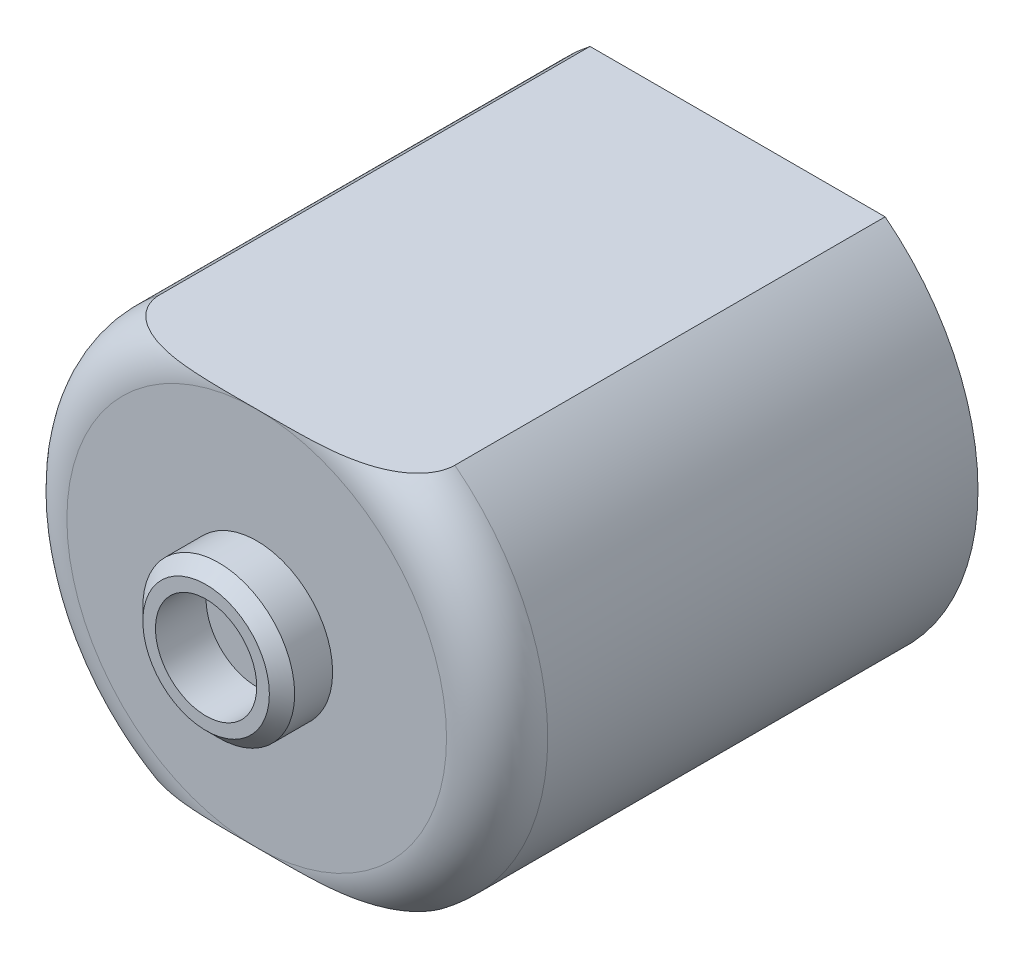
ISO-10303-21;
HEADER;
FILE_DESCRIPTION(('STEP AP214'),'2;1');
FILE_NAME('part.step','',(''),(''),'','','');
FILE_SCHEMA(('AUTOMOTIVE_DESIGN { 1 0 10303 214 1 1 1 1 }'));
ENDSEC;
DATA;
#1=APPLICATION_CONTEXT('core data for automotive mechanical design processes');
#2=APPLICATION_PROTOCOL_DEFINITION('international standard','automotive_design',2000,#1);
#3=PRODUCT_CONTEXT('',#1,'mechanical');
#4=PRODUCT('Part','Part','',(#3));
#5=PRODUCT_RELATED_PRODUCT_CATEGORY('part','',(#4));
#6=PRODUCT_DEFINITION_FORMATION('','',#4);
#7=PRODUCT_DEFINITION_CONTEXT('part definition',#1,'design');
#8=PRODUCT_DEFINITION('design','',#6,#7);
#9=PRODUCT_DEFINITION_SHAPE('','',#8);
#10=(LENGTH_UNIT() NAMED_UNIT(*) SI_UNIT(.MILLI.,.METRE.));
#11=(NAMED_UNIT(*) PLANE_ANGLE_UNIT() SI_UNIT($,.RADIAN.));
#12=(NAMED_UNIT(*) SI_UNIT($,.STERADIAN.) SOLID_ANGLE_UNIT());
#13=UNCERTAINTY_MEASURE_WITH_UNIT(LENGTH_MEASURE(1.E-05),#10,'distance_accuracy_value','');
#14=(GEOMETRIC_REPRESENTATION_CONTEXT(3) GLOBAL_UNCERTAINTY_ASSIGNED_CONTEXT((#13)) GLOBAL_UNIT_ASSIGNED_CONTEXT((#10,
#11,#12)) REPRESENTATION_CONTEXT('',''));
#15=CARTESIAN_POINT('',(0.,0.,0.));
#16=DIRECTION('',(0.,0.,1.));
#17=DIRECTION('',(1.,0.,0.));
#18=AXIS2_PLACEMENT_3D('',#15,#16,#17);
#19=CARTESIAN_POINT('',(0.,0.,19.));
#20=DIRECTION('',(0.,0.,1.));
#21=DIRECTION('',(1.,0.,0.));
#22=AXIS2_PLACEMENT_3D('',#19,#20,#21);
#23=PLANE('',#22);
#24=CARTESIAN_POINT('',(0.,0.,19.));
#25=DIRECTION('',(0.,0.,1.));
#26=DIRECTION('',(1.,0.,0.));
#27=AXIS2_PLACEMENT_3D('',#24,#25,#26);
#28=CIRCLE('',#27,7.5);
#29=CARTESIAN_POINT('',(0.,7.5,19.));
#30=VERTEX_POINT('',#29);
#31=CARTESIAN_POINT('',(0.,-7.5,19.));
#32=VERTEX_POINT('',#31);
#33=EDGE_CURVE('E441',#30,#32,#28,.T.);
#34=ORIENTED_EDGE('',*,*,#33,.T.);
#35=EDGE_CURVE('E440',#32,#30,#28,.T.);
#36=ORIENTED_EDGE('',*,*,#35,.T.);
#37=EDGE_LOOP('',(#34,#36));
#38=FACE_BOUND('',#37,.T.);
#39=CARTESIAN_POINT('',(0.,0.,19.));
#40=DIRECTION('',(0.,0.,1.));
#41=DIRECTION('',(1.,0.,0.));
#42=AXIS2_PLACEMENT_3D('',#39,#40,#41);
#43=CIRCLE('',#42,3.);
#44=CARTESIAN_POINT('',(3.,0.,19.));
#45=VERTEX_POINT('',#44);
#46=EDGE_CURVE('E429',#45,#45,#43,.T.);
#47=ORIENTED_EDGE('',*,*,#46,.F.);
#48=EDGE_LOOP('',(#47));
#49=FACE_BOUND('',#48,.T.);
#50=ADVANCED_FACE('F358',(#38,#49),#23,.T.);
#51=CARTESIAN_POINT('',(0.,0.,19.));
#52=DIRECTION('',(0.,0.,-1.));
#53=DIRECTION('',(-1.,0.,0.));
#54=AXIS2_PLACEMENT_3D('',#51,#52,#53);
#55=CYLINDRICAL_SURFACE('',#54,9.5);
#56=CARTESIAN_POINT('',(0.,0.,17.));
#57=DIRECTION('',(0.,0.,1.));
#58=DIRECTION('',(1.,0.,0.));
#59=AXIS2_PLACEMENT_3D('',#56,#57,#58);
#60=CIRCLE('',#59,9.5);
#61=CARTESIAN_POINT('',(-5.83095189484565,-7.5,17.0000000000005));
#62=VERTEX_POINT('',#61);
#63=CARTESIAN_POINT('',(-5.8309518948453,7.5,17.));
#64=VERTEX_POINT('',#63);
#65=EDGE_CURVE('E444',#62,#64,#60,.F.);
#66=ORIENTED_EDGE('',*,*,#65,.T.);
#67=DIRECTION('',(0.,0.,-1.));
#68=VECTOR('',#67,1.);
#69=CARTESIAN_POINT('',(-5.8309518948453,7.5,19.));
#70=LINE('',#69,#68);
#71=CARTESIAN_POINT('',(-5.8309518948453,7.5,0.));
#72=VERTEX_POINT('',#71);
#73=EDGE_CURVE('E412',#72,#64,#70,.F.);
#74=ORIENTED_EDGE('',*,*,#73,.F.);
#75=CARTESIAN_POINT('',(0.,0.,0.));
#76=DIRECTION('',(0.,0.,1.));
#77=DIRECTION('',(1.,0.,0.));
#78=AXIS2_PLACEMENT_3D('',#75,#76,#77);
#79=CIRCLE('',#78,9.5);
#80=CARTESIAN_POINT('',(-5.8309518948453,-7.5,0.));
#81=VERTEX_POINT('',#80);
#82=EDGE_CURVE('E408',#72,#81,#79,.T.);
#83=ORIENTED_EDGE('',*,*,#82,.T.);
#84=DIRECTION('',(0.,0.,-1.));
#85=VECTOR('',#84,1.);
#86=CARTESIAN_POINT('',(-5.8309518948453,-7.5,19.));
#87=LINE('',#86,#85);
#88=EDGE_CURVE('E410',#62,#81,#87,.T.);
#89=ORIENTED_EDGE('',*,*,#88,.F.);
#90=EDGE_LOOP('',(#66,#74,#83,#89));
#91=FACE_BOUND('',#90,.T.);
#92=ADVANCED_FACE('F360',(#91),#55,.T.);
#93=DIRECTION('',(0.,0.,-1.));
#94=VECTOR('',#93,1.);
#95=CARTESIAN_POINT('',(5.8309518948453,-7.5,19.));
#96=LINE('',#95,#94);
#97=CARTESIAN_POINT('',(5.8309518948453,-7.5,0.));
#98=VERTEX_POINT('',#97);
#99=CARTESIAN_POINT('',(5.8309518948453,-7.5,17.));
#100=VERTEX_POINT('',#99);
#101=EDGE_CURVE('E424',#98,#100,#96,.F.);
#102=ORIENTED_EDGE('',*,*,#101,.F.);
#103=CARTESIAN_POINT('',(5.8309518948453,7.5,0.));
#104=VERTEX_POINT('',#103);
#105=EDGE_CURVE('E416',#98,#104,#79,.T.);
#106=ORIENTED_EDGE('',*,*,#105,.T.);
#107=DIRECTION('',(0.,0.,-1.));
#108=VECTOR('',#107,1.);
#109=CARTESIAN_POINT('',(5.8309518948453,7.5,19.));
#110=LINE('',#109,#108);
#111=CARTESIAN_POINT('',(5.83095189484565,7.5,17.0000000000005));
#112=VERTEX_POINT('',#111);
#113=EDGE_CURVE('E417',#112,#104,#110,.T.);
#114=ORIENTED_EDGE('',*,*,#113,.F.);
#115=EDGE_CURVE('E445',#112,#100,#60,.F.);
#116=ORIENTED_EDGE('',*,*,#115,.T.);
#117=EDGE_LOOP('',(#102,#106,#114,#116));
#118=FACE_BOUND('',#117,.T.);
#119=ADVANCED_FACE('F495',(#118),#55,.T.);
#120=CARTESIAN_POINT('',(0.,0.,0.));
#121=DIRECTION('',(0.,0.,1.));
#122=DIRECTION('',(1.,0.,0.));
#123=AXIS2_PLACEMENT_3D('',#120,#121,#122);
#124=PLANE('',#123);
#125=DIRECTION('',(-1.,0.,0.));
#126=VECTOR('',#125,1.);
#127=CARTESIAN_POINT('',(-9.5,7.5,0.));
#128=LINE('',#127,#126);
#129=EDGE_CURVE('E428',#104,#72,#128,.T.);
#130=ORIENTED_EDGE('',*,*,#129,.F.);
#131=ORIENTED_EDGE('',*,*,#105,.F.);
#132=DIRECTION('',(1.,0.,0.));
#133=VECTOR('',#132,1.);
#134=CARTESIAN_POINT('',(-9.5,-7.5,0.));
#135=LINE('',#134,#133);
#136=EDGE_CURVE('E421',#81,#98,#135,.T.);
#137=ORIENTED_EDGE('',*,*,#136,.F.);
#138=ORIENTED_EDGE('',*,*,#82,.F.);
#139=EDGE_LOOP('',(#130,#131,#137,#138));
#140=FACE_BOUND('',#139,.T.);
#141=ADVANCED_FACE('F426',(#140),#124,.F.);
#142=CARTESIAN_POINT('',(0.,0.,17.));
#143=DIRECTION('',(0.,0.,1.));
#144=DIRECTION('',(1.,0.,0.));
#145=AXIS2_PLACEMENT_3D('',#142,#143,#144);
#146=TOROIDAL_SURFACE('',#145,7.5,2.);
#147=ORIENTED_EDGE('',*,*,#33,.F.);
#148=CARTESIAN_POINT('',(0.,7.5,19.0000000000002));
#149=CARTESIAN_POINT('',(-0.168645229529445,7.5,19.0000001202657));
#150=CARTESIAN_POINT('',(-0.337290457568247,7.5,19.0000243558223));
#151=CARTESIAN_POINT('',(-0.674588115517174,7.5,18.9998303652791));
#152=CARTESIAN_POINT('',(-0.843240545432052,7.5,18.9996121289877));
#153=CARTESIAN_POINT('',(-1.18100400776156,7.5,18.9980762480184));
#154=CARTESIAN_POINT('',(-1.35011503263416,7.5,18.9967555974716));
#155=CARTESIAN_POINT('',(-1.68829538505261,7.5,18.9916270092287));
#156=CARTESIAN_POINT('',(-1.85736471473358,7.5,18.9878192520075));
#157=CARTESIAN_POINT('',(-2.19272713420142,7.5,18.9759495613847));
#158=CARTESIAN_POINT('',(-2.35902235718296,7.5,18.9679549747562));
#159=CARTESIAN_POINT('',(-2.69127574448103,7.5,18.9455429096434));
#160=CARTESIAN_POINT('',(-2.85723376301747,7.5,18.9311230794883));
#161=CARTESIAN_POINT('',(-3.18746730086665,7.5,18.8932809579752));
#162=CARTESIAN_POINT('',(-3.35174693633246,7.5,18.8698960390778));
#163=CARTESIAN_POINT('',(-3.67807384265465,7.5,18.8109958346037));
#164=CARTESIAN_POINT('',(-3.84012336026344,7.5,18.7754938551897));
#165=CARTESIAN_POINT('',(-4.06748234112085,7.5,18.7137139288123));
#166=CARTESIAN_POINT('',(-4.13457756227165,7.5,18.6939622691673));
#167=CARTESIAN_POINT('',(-4.2677861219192,7.5,18.6512868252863));
#168=CARTESIAN_POINT('',(-4.33389910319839,7.5,18.6283619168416));
#169=CARTESIAN_POINT('',(-4.46502273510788,7.5,18.5789224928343));
#170=CARTESIAN_POINT('',(-4.5300292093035,7.5,18.5523967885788));
#171=CARTESIAN_POINT('',(-4.65829638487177,7.5,18.4954488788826));
#172=CARTESIAN_POINT('',(-4.72155726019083,7.5,18.4650270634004));
#173=CARTESIAN_POINT('',(-4.909570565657,7.5,18.366528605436));
#174=CARTESIAN_POINT('',(-5.0309733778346,7.5,18.2917868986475));
#175=CARTESIAN_POINT('',(-5.25832704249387,7.5,18.1217214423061));
#176=CARTESIAN_POINT('',(-5.36433964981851,7.5,18.0264839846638));
#177=CARTESIAN_POINT('',(-5.51211515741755,7.5,17.858705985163));
#178=CARTESIAN_POINT('',(-5.56215051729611,7.5,17.7934598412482));
#179=CARTESIAN_POINT('',(-5.65145275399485,7.5,17.6558985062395));
#180=CARTESIAN_POINT('',(-5.69072545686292,7.5,17.583587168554));
#181=CARTESIAN_POINT('',(-5.75621869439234,7.5,17.4323847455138));
#182=CARTESIAN_POINT('',(-5.78231522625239,7.5,17.353439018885));
#183=CARTESIAN_POINT('',(-5.81862408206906,7.5,17.1919674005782));
#184=CARTESIAN_POINT('',(-5.82885110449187,7.5,17.1094448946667));
#185=CARTESIAN_POINT('',(-5.83224156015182,7.5,16.9544841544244));
#186=CARTESIAN_POINT('',(-5.82738969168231,7.5,16.8820832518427));
#187=CARTESIAN_POINT('',(-5.80522095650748,7.5,16.7392322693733));
#188=CARTESIAN_POINT('',(-5.78790369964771,7.5,16.6687822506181));
#189=CARTESIAN_POINT('',(-5.7426200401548,7.5,16.5334810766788));
#190=CARTESIAN_POINT('',(-5.71494120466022,7.5,16.4685321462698));
#191=CARTESIAN_POINT('',(-5.65047954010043,7.5,16.3433683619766));
#192=CARTESIAN_POINT('',(-5.613693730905,7.5,16.2831550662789));
#193=CARTESIAN_POINT('',(-5.51275461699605,7.5,16.1398080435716));
#194=CARTESIAN_POINT('',(-5.44402225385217,7.5,16.0598952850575));
#195=CARTESIAN_POINT('',(-5.29467203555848,7.5,15.9120499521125));
#196=CARTESIAN_POINT('',(-5.21402358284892,7.5,15.844149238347));
#197=CARTESIAN_POINT('',(-4.9989076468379,7.5,15.6860111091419));
#198=CARTESIAN_POINT('',(-4.85884583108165,7.5,15.6034362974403));
#199=CARTESIAN_POINT('',(-4.568235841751,7.5,15.4603555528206));
#200=CARTESIAN_POINT('',(-4.417677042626,7.5,15.3998723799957));
#201=CARTESIAN_POINT('',(-4.07615386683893,7.5,15.2846553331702));
#202=CARTESIAN_POINT('',(-3.88374515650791,7.5,15.2343069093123));
#203=CARTESIAN_POINT('',(-3.49480380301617,7.5,15.1527355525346));
#204=CARTESIAN_POINT('',(-3.29826373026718,7.5,15.1215507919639));
#205=CARTESIAN_POINT('',(-2.90217133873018,7.5,15.0725804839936));
#206=CARTESIAN_POINT('',(-2.70260750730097,7.5,15.0548941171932));
#207=CARTESIAN_POINT('',(-2.303108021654,7.5,15.0286392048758));
#208=CARTESIAN_POINT('',(-2.10317278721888,7.5,15.0200634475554));
#209=CARTESIAN_POINT('',(-1.71305969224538,7.5,15.0085797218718));
#210=CARTESIAN_POINT('',(-1.52288812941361,7.5,15.0054125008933));
#211=CARTESIAN_POINT('',(-1.14251404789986,7.5,15.0014949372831));
#212=CARTESIAN_POINT('',(-0.95231152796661,7.5,15.0007447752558));
#213=CARTESIAN_POINT('',(-0.571785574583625,7.5,15.0000008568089));
#214=CARTESIAN_POINT('',(-0.381462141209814,7.5,15.0000075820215));
#215=CARTESIAN_POINT('',(-0.000826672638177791,7.5,14.9999953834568));
#216=CARTESIAN_POINT('',(0.189485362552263,7.5,14.9999764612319));
#217=CARTESIAN_POINT('',(0.569731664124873,7.5,15.0000696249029));
#218=CARTESIAN_POINT('',(0.759665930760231,7.5,15.0001814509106));
#219=CARTESIAN_POINT('',(1.13955777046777,7.5,15.0016116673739));
#220=CARTESIAN_POINT('',(1.32951534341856,7.5,15.0029302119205));
#221=CARTESIAN_POINT('',(1.70921337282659,7.5,15.0086920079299));
#222=CARTESIAN_POINT('',(1.8989538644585,7.5,15.0131322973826));
#223=CARTESIAN_POINT('',(2.27819657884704,7.5,15.0277980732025));
#224=CARTESIAN_POINT('',(2.46769885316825,7.5,15.0380219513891));
#225=CARTESIAN_POINT('',(2.80311412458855,7.5,15.0642956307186));
#226=CARTESIAN_POINT('',(2.949165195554,7.5,15.0784981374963));
#227=CARTESIAN_POINT('',(3.24047019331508,7.5,15.1143022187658));
#228=CARTESIAN_POINT('',(3.38572368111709,7.5,15.1359075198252));
#229=CARTESIAN_POINT('',(3.67368939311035,7.5,15.1885764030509));
#230=CARTESIAN_POINT('',(3.81641145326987,7.5,15.2195845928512));
#231=CARTESIAN_POINT('',(4.09864048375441,7.5,15.2936325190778));
#232=CARTESIAN_POINT('',(4.23815086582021,7.5,15.336658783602));
#233=CARTESIAN_POINT('',(4.48952662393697,7.5,15.4295462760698));
#234=CARTESIAN_POINT('',(4.60220668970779,7.5,15.4771681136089));
#235=CARTESIAN_POINT('',(4.82175976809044,7.5,15.5850912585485));
#236=CARTESIAN_POINT('',(4.9286200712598,7.5,15.6454190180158));
#237=CARTESIAN_POINT('',(5.13406173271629,7.5,15.781552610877));
#238=CARTESIAN_POINT('',(5.23252717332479,7.5,15.8575370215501));
#239=CARTESIAN_POINT('',(5.41401824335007,7.5,16.0261038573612));
#240=CARTESIAN_POINT('',(5.49709912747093,7.5,16.1186244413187));
#241=CARTESIAN_POINT('',(5.61375119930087,7.5,16.2826276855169));
#242=CARTESIAN_POINT('',(5.65425503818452,7.5,16.3491803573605));
#243=CARTESIAN_POINT('',(5.72402492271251,7.5,16.4879889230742));
#244=CARTESIAN_POINT('',(5.75329777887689,7.5,16.5602413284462));
#245=CARTESIAN_POINT('',(5.79872088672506,7.5,16.7093791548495));
#246=CARTESIAN_POINT('',(5.81477744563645,7.5,16.7862935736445));
#247=CARTESIAN_POINT('',(5.83204318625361,7.5,16.9417745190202));
#248=CARTESIAN_POINT('',(5.83325931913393,7.5,17.020340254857));
#249=CARTESIAN_POINT('',(5.82140602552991,7.5,17.1682778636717));
#250=CARTESIAN_POINT('',(5.80977909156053,7.5,17.2377710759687));
#251=CARTESIAN_POINT('',(5.77532138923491,7.5,17.3738957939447));
#252=CARTESIAN_POINT('',(5.75248935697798,7.5,17.440526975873));
#253=CARTESIAN_POINT('',(5.69622166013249,7.5,17.5713559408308));
#254=CARTESIAN_POINT('',(5.66250268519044,7.5,17.6354304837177));
#255=CARTESIAN_POINT('',(5.58644879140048,7.5,17.7582042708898));
#256=CARTESIAN_POINT('',(5.54410924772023,7.5,17.816900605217));
#257=CARTESIAN_POINT('',(5.42595198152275,7.5,17.9609408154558));
#258=CARTESIAN_POINT('',(5.34494596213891,7.5,18.0420319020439));
#259=CARTESIAN_POINT('',(5.1711360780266,7.5,18.1904189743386));
#260=CARTESIAN_POINT('',(5.07830247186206,7.5,18.2576790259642));
#261=CARTESIAN_POINT('',(4.90413423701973,7.5,18.367556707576));
#262=CARTESIAN_POINT('',(4.82418222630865,7.5,18.4124150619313));
#263=CARTESIAN_POINT('',(4.66063563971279,7.5,18.4950063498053));
#264=CARTESIAN_POINT('',(4.57703843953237,7.5,18.5327340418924));
#265=CARTESIAN_POINT('',(4.40723921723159,7.5,18.6018965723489));
#266=CARTESIAN_POINT('',(4.32103532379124,7.5,18.6333267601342));
#267=CARTESIAN_POINT('',(4.1468812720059,7.5,18.6906363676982));
#268=CARTESIAN_POINT('',(4.05893216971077,7.5,18.7165190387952));
#269=CARTESIAN_POINT('',(3.81123406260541,7.5,18.7822031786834));
#270=CARTESIAN_POINT('',(3.65007357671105,7.5,18.8166782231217));
#271=CARTESIAN_POINT('',(3.32563556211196,7.5,18.8738657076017));
#272=CARTESIAN_POINT('',(3.16235605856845,7.5,18.8965662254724));
#273=CARTESIAN_POINT('',(2.8342095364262,7.5,18.933287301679));
#274=CARTESIAN_POINT('',(2.66933879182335,7.5,18.9472731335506));
#275=CARTESIAN_POINT('',(2.33927546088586,7.5,18.9690028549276));
#276=CARTESIAN_POINT('',(2.17408300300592,7.5,18.9767488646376));
#277=CARTESIAN_POINT('',(1.84129125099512,7.5,18.9882309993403));
#278=CARTESIAN_POINT('',(1.6736902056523,7.5,18.9919103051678));
#279=CARTESIAN_POINT('',(1.33844919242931,7.5,18.9968656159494));
#280=CARTESIAN_POINT('',(1.17080922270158,7.5,18.9981414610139));
#281=CARTESIAN_POINT('',(0.835970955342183,7.5,18.9996253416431));
#282=CARTESIAN_POINT('',(0.668772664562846,7.5,18.9998361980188));
#283=CARTESIAN_POINT('',(0.334382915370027,7.5,19.0000234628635));
#284=CARTESIAN_POINT('',(0.167191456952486,7.5,18.9999998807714));
#285=CARTESIAN_POINT('',(0.,7.5,19.0000000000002));
#286=B_SPLINE_CURVE_WITH_KNOTS('',3,(#148,#149,#150,#151,#152,#153,#154,#155,#156,#157,#158,
#159,#160,#161,#162,#163,#164,#165,#166,#167,#168,#169,#170,#171,#172,#173,#174,#175,#176,#177,
#178,#179,#180,#181,#182,#183,#184,#185,#186,#187,#188,#189,#190,#191,#192,#193,#194,#195,#196,
#197,#198,#199,#200,#201,#202,#203,#204,#205,#206,#207,#208,#209,#210,#211,#212,#213,#214,#215,
#216,#217,#218,#219,#220,#221,#222,#223,#224,#225,#226,#227,#228,#229,#230,#231,#232,#233,#234,
#235,#236,#237,#238,#239,#240,#241,#242,#243,#244,#245,#246,#247,#248,#249,#250,#251,#252,#253,
#254,#255,#256,#257,#258,#259,#260,#261,#262,#263,#264,#265,#266,#267,#268,#269,#270,#271,#272,
#273,#274,#275,#276,#277,#278,#279,#280,#281,#282,#283,#284,#285),.UNSPECIFIED.,.T.,.F.,(4,2,2,
2,2,2,2,2,2,2,2,2,2,2,2,2,2,2,2,2,2,2,2,2,2,2,2,2,2,2,2,2,2,2,2,2,2,2,2,2,2,2,2,2,2,2,2,2,2,2,2,
2,2,2,2,2,2,2,2,2,2,2,2,2,2,2,2,2,4),(0.,0.505935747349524,1.01189276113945,1.51923385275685,
2.02653813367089,2.52592209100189,3.0254889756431,3.52299558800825,4.01995761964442,
4.22972035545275,4.43955759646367,4.65006245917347,4.86054626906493,5.2865133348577,
5.71072089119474,5.95655996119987,6.20226568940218,6.4502425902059,6.69798967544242,
6.9145710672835,7.1311592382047,7.34213519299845,7.55318027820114,7.86760684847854,
8.18285528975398,8.66787070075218,9.15338440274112,9.74857826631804,10.3449538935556,
10.945670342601,11.5459109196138,12.1164757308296,12.6870831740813,13.258053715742,
13.8289896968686,14.3987927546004,14.9686685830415,15.5380044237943,16.107182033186,
16.5472659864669,16.9875718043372,17.4253325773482,17.8626045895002,18.2289765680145,
18.5961189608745,18.9677070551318,19.3379335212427,19.5708026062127,19.8035302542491,
20.0378938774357,20.2721477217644,20.4825407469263,20.6929575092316,20.9093632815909,
21.1258854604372,21.4677964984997,21.8105849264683,22.0852311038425,22.3600783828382,
22.6351278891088,22.9100157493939,23.4037759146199,23.898035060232,24.3942513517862,
24.8902989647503,25.3931929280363,25.8961203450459,26.3977149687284,26.8992893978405),.UNSPECIFIED.);
#287=EDGE_CURVE('E381',#30,#64,#286,.T.);
#288=ORIENTED_EDGE('',*,*,#287,.T.);
#289=ORIENTED_EDGE('',*,*,#65,.F.);
#290=CARTESIAN_POINT('',(0.,-7.5,19.0000000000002));
#291=CARTESIAN_POINT('',(0.168645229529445,-7.5,19.0000001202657));
#292=CARTESIAN_POINT('',(0.337290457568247,-7.5,19.0000243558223));
#293=CARTESIAN_POINT('',(0.674588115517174,-7.5,18.9998303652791));
#294=CARTESIAN_POINT('',(0.843240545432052,-7.5,18.9996121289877));
#295=CARTESIAN_POINT('',(1.18100400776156,-7.5,18.9980762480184));
#296=CARTESIAN_POINT('',(1.35011503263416,-7.5,18.9967555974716));
#297=CARTESIAN_POINT('',(1.68829538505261,-7.5,18.9916270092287));
#298=CARTESIAN_POINT('',(1.85736471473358,-7.5,18.9878192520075));
#299=CARTESIAN_POINT('',(2.19272713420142,-7.5,18.9759495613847));
#300=CARTESIAN_POINT('',(2.35902235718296,-7.5,18.9679549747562));
#301=CARTESIAN_POINT('',(2.69127574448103,-7.5,18.9455429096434));
#302=CARTESIAN_POINT('',(2.85723376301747,-7.5,18.9311230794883));
#303=CARTESIAN_POINT('',(3.18746730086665,-7.5,18.8932809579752));
#304=CARTESIAN_POINT('',(3.35174693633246,-7.5,18.8698960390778));
#305=CARTESIAN_POINT('',(3.67807384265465,-7.5,18.8109958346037));
#306=CARTESIAN_POINT('',(3.84012336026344,-7.5,18.7754938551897));
#307=CARTESIAN_POINT('',(4.06748234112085,-7.5,18.7137139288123));
#308=CARTESIAN_POINT('',(4.13457756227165,-7.5,18.6939622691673));
#309=CARTESIAN_POINT('',(4.2677861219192,-7.5,18.6512868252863));
#310=CARTESIAN_POINT('',(4.33389910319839,-7.5,18.6283619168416));
#311=CARTESIAN_POINT('',(4.46502273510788,-7.5,18.5789224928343));
#312=CARTESIAN_POINT('',(4.5300292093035,-7.5,18.5523967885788));
#313=CARTESIAN_POINT('',(4.65829638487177,-7.5,18.4954488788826));
#314=CARTESIAN_POINT('',(4.72155726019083,-7.5,18.4650270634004));
#315=CARTESIAN_POINT('',(4.909570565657,-7.5,18.366528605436));
#316=CARTESIAN_POINT('',(5.0309733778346,-7.5,18.2917868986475));
#317=CARTESIAN_POINT('',(5.25832704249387,-7.5,18.1217214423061));
#318=CARTESIAN_POINT('',(5.36433964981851,-7.5,18.0264839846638));
#319=CARTESIAN_POINT('',(5.51211515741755,-7.5,17.858705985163));
#320=CARTESIAN_POINT('',(5.56215051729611,-7.5,17.7934598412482));
#321=CARTESIAN_POINT('',(5.65145275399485,-7.5,17.6558985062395));
#322=CARTESIAN_POINT('',(5.69072545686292,-7.5,17.583587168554));
#323=CARTESIAN_POINT('',(5.75621869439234,-7.5,17.4323847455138));
#324=CARTESIAN_POINT('',(5.78231522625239,-7.5,17.353439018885));
#325=CARTESIAN_POINT('',(5.81862408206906,-7.5,17.1919674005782));
#326=CARTESIAN_POINT('',(5.82885110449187,-7.5,17.1094448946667));
#327=CARTESIAN_POINT('',(5.83224156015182,-7.5,16.9544841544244));
#328=CARTESIAN_POINT('',(5.82738969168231,-7.5,16.8820832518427));
#329=CARTESIAN_POINT('',(5.80522095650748,-7.5,16.7392322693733));
#330=CARTESIAN_POINT('',(5.78790369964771,-7.5,16.6687822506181));
#331=CARTESIAN_POINT('',(5.7426200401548,-7.5,16.5334810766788));
#332=CARTESIAN_POINT('',(5.71494120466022,-7.5,16.4685321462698));
#333=CARTESIAN_POINT('',(5.65047954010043,-7.5,16.3433683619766));
#334=CARTESIAN_POINT('',(5.613693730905,-7.5,16.2831550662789));
#335=CARTESIAN_POINT('',(5.51275461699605,-7.5,16.1398080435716));
#336=CARTESIAN_POINT('',(5.44402225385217,-7.5,16.0598952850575));
#337=CARTESIAN_POINT('',(5.29467203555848,-7.5,15.9120499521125));
#338=CARTESIAN_POINT('',(5.21402358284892,-7.5,15.844149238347));
#339=CARTESIAN_POINT('',(4.9989076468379,-7.5,15.6860111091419));
#340=CARTESIAN_POINT('',(4.85884583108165,-7.5,15.6034362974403));
#341=CARTESIAN_POINT('',(4.568235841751,-7.5,15.4603555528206));
#342=CARTESIAN_POINT('',(4.417677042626,-7.5,15.3998723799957));
#343=CARTESIAN_POINT('',(4.07615386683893,-7.5,15.2846553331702));
#344=CARTESIAN_POINT('',(3.88374515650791,-7.5,15.2343069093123));
#345=CARTESIAN_POINT('',(3.49480380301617,-7.5,15.1527355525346));
#346=CARTESIAN_POINT('',(3.29826373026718,-7.5,15.1215507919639));
#347=CARTESIAN_POINT('',(2.90217133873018,-7.5,15.0725804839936));
#348=CARTESIAN_POINT('',(2.70260750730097,-7.5,15.0548941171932));
#349=CARTESIAN_POINT('',(2.303108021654,-7.5,15.0286392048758));
#350=CARTESIAN_POINT('',(2.10317278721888,-7.5,15.0200634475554));
#351=CARTESIAN_POINT('',(1.71305969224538,-7.5,15.0085797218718));
#352=CARTESIAN_POINT('',(1.52288812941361,-7.5,15.0054125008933));
#353=CARTESIAN_POINT('',(1.14251404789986,-7.5,15.0014949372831));
#354=CARTESIAN_POINT('',(0.95231152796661,-7.5,15.0007447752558));
#355=CARTESIAN_POINT('',(0.571785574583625,-7.5,15.0000008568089));
#356=CARTESIAN_POINT('',(0.381462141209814,-7.5,15.0000075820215));
#357=CARTESIAN_POINT('',(0.000826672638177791,-7.5,14.9999953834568));
#358=CARTESIAN_POINT('',(-0.189485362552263,-7.5,14.9999764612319));
#359=CARTESIAN_POINT('',(-0.569731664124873,-7.5,15.0000696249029));
#360=CARTESIAN_POINT('',(-0.759665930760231,-7.5,15.0001814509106));
#361=CARTESIAN_POINT('',(-1.13955777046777,-7.5,15.0016116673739));
#362=CARTESIAN_POINT('',(-1.32951534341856,-7.5,15.0029302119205));
#363=CARTESIAN_POINT('',(-1.70921337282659,-7.5,15.0086920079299));
#364=CARTESIAN_POINT('',(-1.8989538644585,-7.5,15.0131322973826));
#365=CARTESIAN_POINT('',(-2.27819657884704,-7.5,15.0277980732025));
#366=CARTESIAN_POINT('',(-2.46769885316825,-7.5,15.0380219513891));
#367=CARTESIAN_POINT('',(-2.80311412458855,-7.5,15.0642956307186));
#368=CARTESIAN_POINT('',(-2.949165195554,-7.5,15.0784981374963));
#369=CARTESIAN_POINT('',(-3.24047019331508,-7.5,15.1143022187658));
#370=CARTESIAN_POINT('',(-3.38572368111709,-7.5,15.1359075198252));
#371=CARTESIAN_POINT('',(-3.67368939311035,-7.5,15.1885764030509));
#372=CARTESIAN_POINT('',(-3.81641145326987,-7.5,15.2195845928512));
#373=CARTESIAN_POINT('',(-4.09864048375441,-7.5,15.2936325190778));
#374=CARTESIAN_POINT('',(-4.23815086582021,-7.5,15.336658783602));
#375=CARTESIAN_POINT('',(-4.48952662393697,-7.5,15.4295462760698));
#376=CARTESIAN_POINT('',(-4.60220668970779,-7.5,15.4771681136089));
#377=CARTESIAN_POINT('',(-4.82175976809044,-7.5,15.5850912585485));
#378=CARTESIAN_POINT('',(-4.9286200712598,-7.5,15.6454190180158));
#379=CARTESIAN_POINT('',(-5.13406173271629,-7.5,15.781552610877));
#380=CARTESIAN_POINT('',(-5.23252717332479,-7.5,15.8575370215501));
#381=CARTESIAN_POINT('',(-5.41401824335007,-7.5,16.0261038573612));
#382=CARTESIAN_POINT('',(-5.49709912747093,-7.5,16.1186244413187));
#383=CARTESIAN_POINT('',(-5.61375119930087,-7.5,16.2826276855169));
#384=CARTESIAN_POINT('',(-5.65425503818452,-7.5,16.3491803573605));
#385=CARTESIAN_POINT('',(-5.72402492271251,-7.5,16.4879889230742));
#386=CARTESIAN_POINT('',(-5.75329777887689,-7.5,16.5602413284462));
#387=CARTESIAN_POINT('',(-5.79872088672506,-7.5,16.7093791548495));
#388=CARTESIAN_POINT('',(-5.81477744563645,-7.5,16.7862935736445));
#389=CARTESIAN_POINT('',(-5.83204318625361,-7.5,16.9417745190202));
#390=CARTESIAN_POINT('',(-5.83325931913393,-7.5,17.020340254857));
#391=CARTESIAN_POINT('',(-5.82140602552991,-7.5,17.1682778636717));
#392=CARTESIAN_POINT('',(-5.80977909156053,-7.5,17.2377710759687));
#393=CARTESIAN_POINT('',(-5.77532138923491,-7.5,17.3738957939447));
#394=CARTESIAN_POINT('',(-5.75248935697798,-7.5,17.440526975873));
#395=CARTESIAN_POINT('',(-5.69622166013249,-7.5,17.5713559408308));
#396=CARTESIAN_POINT('',(-5.66250268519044,-7.5,17.6354304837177));
#397=CARTESIAN_POINT('',(-5.58644879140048,-7.5,17.7582042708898));
#398=CARTESIAN_POINT('',(-5.54410924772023,-7.5,17.816900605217));
#399=CARTESIAN_POINT('',(-5.42595198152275,-7.5,17.9609408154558));
#400=CARTESIAN_POINT('',(-5.34494596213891,-7.5,18.0420319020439));
#401=CARTESIAN_POINT('',(-5.1711360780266,-7.5,18.1904189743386));
#402=CARTESIAN_POINT('',(-5.07830247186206,-7.5,18.2576790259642));
#403=CARTESIAN_POINT('',(-4.90413423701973,-7.5,18.367556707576));
#404=CARTESIAN_POINT('',(-4.82418222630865,-7.5,18.4124150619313));
#405=CARTESIAN_POINT('',(-4.66063563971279,-7.5,18.4950063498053));
#406=CARTESIAN_POINT('',(-4.57703843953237,-7.5,18.5327340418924));
#407=CARTESIAN_POINT('',(-4.40723921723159,-7.5,18.6018965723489));
#408=CARTESIAN_POINT('',(-4.32103532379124,-7.5,18.6333267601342));
#409=CARTESIAN_POINT('',(-4.1468812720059,-7.5,18.6906363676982));
#410=CARTESIAN_POINT('',(-4.05893216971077,-7.5,18.7165190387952));
#411=CARTESIAN_POINT('',(-3.81123406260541,-7.5,18.7822031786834));
#412=CARTESIAN_POINT('',(-3.65007357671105,-7.5,18.8166782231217));
#413=CARTESIAN_POINT('',(-3.32563556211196,-7.5,18.8738657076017));
#414=CARTESIAN_POINT('',(-3.16235605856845,-7.5,18.8965662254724));
#415=CARTESIAN_POINT('',(-2.8342095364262,-7.5,18.933287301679));
#416=CARTESIAN_POINT('',(-2.66933879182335,-7.5,18.9472731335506));
#417=CARTESIAN_POINT('',(-2.33927546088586,-7.5,18.9690028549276));
#418=CARTESIAN_POINT('',(-2.17408300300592,-7.5,18.9767488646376));
#419=CARTESIAN_POINT('',(-1.84129125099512,-7.5,18.9882309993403));
#420=CARTESIAN_POINT('',(-1.6736902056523,-7.5,18.9919103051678));
#421=CARTESIAN_POINT('',(-1.33844919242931,-7.5,18.9968656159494));
#422=CARTESIAN_POINT('',(-1.17080922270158,-7.5,18.9981414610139));
#423=CARTESIAN_POINT('',(-0.835970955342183,-7.5,18.9996253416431));
#424=CARTESIAN_POINT('',(-0.668772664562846,-7.5,18.9998361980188));
#425=CARTESIAN_POINT('',(-0.334382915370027,-7.5,19.0000234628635));
#426=CARTESIAN_POINT('',(-0.167191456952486,-7.5,18.9999998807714));
#427=CARTESIAN_POINT('',(0.,-7.5,19.0000000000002));
#428=B_SPLINE_CURVE_WITH_KNOTS('',3,(#290,#291,#292,#293,#294,#295,#296,#297,#298,#299,#300,
#301,#302,#303,#304,#305,#306,#307,#308,#309,#310,#311,#312,#313,#314,#315,#316,#317,#318,#319,
#320,#321,#322,#323,#324,#325,#326,#327,#328,#329,#330,#331,#332,#333,#334,#335,#336,#337,#338,
#339,#340,#341,#342,#343,#344,#345,#346,#347,#348,#349,#350,#351,#352,#353,#354,#355,#356,#357,
#358,#359,#360,#361,#362,#363,#364,#365,#366,#367,#368,#369,#370,#371,#372,#373,#374,#375,#376,
#377,#378,#379,#380,#381,#382,#383,#384,#385,#386,#387,#388,#389,#390,#391,#392,#393,#394,#395,
#396,#397,#398,#399,#400,#401,#402,#403,#404,#405,#406,#407,#408,#409,#410,#411,#412,#413,#414,
#415,#416,#417,#418,#419,#420,#421,#422,#423,#424,#425,#426,#427),.UNSPECIFIED.,.T.,.F.,(4,2,2,
2,2,2,2,2,2,2,2,2,2,2,2,2,2,2,2,2,2,2,2,2,2,2,2,2,2,2,2,2,2,2,2,2,2,2,2,2,2,2,2,2,2,2,2,2,2,2,2,
2,2,2,2,2,2,2,2,2,2,2,2,2,2,2,2,2,4),(0.,0.505935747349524,1.01189276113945,1.51923385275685,
2.02653813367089,2.52592209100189,3.0254889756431,3.52299558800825,4.01995761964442,
4.22972035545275,4.43955759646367,4.65006245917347,4.86054626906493,5.2865133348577,
5.71072089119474,5.95655996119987,6.20226568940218,6.4502425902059,6.69798967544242,
6.9145710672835,7.1311592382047,7.34213519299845,7.55318027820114,7.86760684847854,
8.18285528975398,8.66787070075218,9.15338440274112,9.74857826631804,10.3449538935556,
10.945670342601,11.5459109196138,12.1164757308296,12.6870831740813,13.258053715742,
13.8289896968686,14.3987927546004,14.9686685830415,15.5380044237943,16.107182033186,
16.5472659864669,16.9875718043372,17.4253325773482,17.8626045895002,18.2289765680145,
18.5961189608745,18.9677070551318,19.3379335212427,19.5708026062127,19.8035302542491,
20.0378938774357,20.2721477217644,20.4825407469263,20.6929575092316,20.9093632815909,
21.1258854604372,21.4677964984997,21.8105849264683,22.0852311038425,22.3600783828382,
22.6351278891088,22.9100157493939,23.4037759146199,23.898035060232,24.3942513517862,
24.8902989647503,25.3931929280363,25.8961203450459,26.3977149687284,26.8992893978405),.UNSPECIFIED.);
#429=EDGE_CURVE('E423',#62,#32,#428,.T.);
#430=ORIENTED_EDGE('',*,*,#429,.T.);
#431=EDGE_LOOP('',(#147,#288,#289,#430));
#432=FACE_BOUND('',#431,.T.);
#433=ADVANCED_FACE('F458',(#432),#146,.T.);
#434=ORIENTED_EDGE('',*,*,#115,.F.);
#435=EDGE_CURVE('E453',#112,#30,#286,.T.);
#436=ORIENTED_EDGE('',*,*,#435,.T.);
#437=ORIENTED_EDGE('',*,*,#35,.F.);
#438=EDGE_CURVE('E373',#32,#100,#428,.T.);
#439=ORIENTED_EDGE('',*,*,#438,.T.);
#440=EDGE_LOOP('',(#434,#436,#437,#439));
#441=FACE_BOUND('',#440,.T.);
#442=ADVANCED_FACE('F464',(#441),#146,.T.);
#443=CARTESIAN_POINT('',(-9.5,-7.5,0.));
#444=DIRECTION('',(0.,-1.,0.));
#445=DIRECTION('',(0.,0.,-1.));
#446=AXIS2_PLACEMENT_3D('',#443,#444,#445);
#447=PLANE('',#446);
#448=ORIENTED_EDGE('',*,*,#88,.T.);
#449=ORIENTED_EDGE('',*,*,#136,.T.);
#450=ORIENTED_EDGE('',*,*,#101,.T.);
#451=ORIENTED_EDGE('',*,*,#438,.F.);
#452=ORIENTED_EDGE('',*,*,#429,.F.);
#453=EDGE_LOOP('',(#448,#449,#450,#451,#452));
#454=FACE_BOUND('',#453,.T.);
#455=ADVANCED_FACE('F420',(#454),#447,.T.);
#456=CARTESIAN_POINT('',(-9.5,7.5,0.));
#457=DIRECTION('',(0.,1.,0.));
#458=DIRECTION('',(0.,0.,1.));
#459=AXIS2_PLACEMENT_3D('',#456,#457,#458);
#460=PLANE('',#459);
#461=ORIENTED_EDGE('',*,*,#113,.T.);
#462=ORIENTED_EDGE('',*,*,#129,.T.);
#463=ORIENTED_EDGE('',*,*,#73,.T.);
#464=ORIENTED_EDGE('',*,*,#287,.F.);
#465=ORIENTED_EDGE('',*,*,#435,.F.);
#466=EDGE_LOOP('',(#461,#462,#463,#464,#465));
#467=FACE_BOUND('',#466,.T.);
#468=ADVANCED_FACE('F463',(#467),#460,.T.);
#469=CARTESIAN_POINT('',(0.,0.,21.));
#470=DIRECTION('',(0.,0.,1.));
#471=DIRECTION('',(1.,0.,0.));
#472=AXIS2_PLACEMENT_3D('',#469,#470,#471);
#473=PLANE('',#472);
#474=CARTESIAN_POINT('',(0.,0.,21.));
#475=DIRECTION('',(0.,0.,1.));
#476=DIRECTION('',(1.,0.,0.));
#477=AXIS2_PLACEMENT_3D('',#474,#475,#476);
#478=CIRCLE('',#477,2.5);
#479=CARTESIAN_POINT('',(2.5,0.,21.));
#480=VERTEX_POINT('',#479);
#481=EDGE_CURVE('E366',#480,#480,#478,.T.);
#482=ORIENTED_EDGE('',*,*,#481,.T.);
#483=EDGE_LOOP('',(#482));
#484=FACE_BOUND('',#483,.T.);
#485=CARTESIAN_POINT('',(0.,0.,21.));
#486=DIRECTION('',(0.,0.,1.));
#487=DIRECTION('',(1.,0.,0.));
#488=AXIS2_PLACEMENT_3D('',#485,#486,#487);
#489=CIRCLE('',#488,2.);
#490=CARTESIAN_POINT('',(2.,0.,21.));
#491=VERTEX_POINT('',#490);
#492=EDGE_CURVE('E433',#491,#491,#489,.T.);
#493=ORIENTED_EDGE('',*,*,#492,.F.);
#494=EDGE_LOOP('',(#493));
#495=FACE_BOUND('',#494,.T.);
#496=ADVANCED_FACE('F468',(#484,#495),#473,.T.);
#497=CARTESIAN_POINT('',(0.,0.,21.));
#498=DIRECTION('',(0.,0.,-1.));
#499=DIRECTION('',(-1.,0.,0.));
#500=AXIS2_PLACEMENT_3D('',#497,#498,#499);
#501=CYLINDRICAL_SURFACE('',#500,3.);
#502=CARTESIAN_POINT('',(0.,0.,20.5));
#503=DIRECTION('',(0.,0.,1.));
#504=DIRECTION('',(1.,0.,0.));
#505=AXIS2_PLACEMENT_3D('',#502,#503,#504);
#506=CIRCLE('',#505,3.);
#507=CARTESIAN_POINT('',(3.,0.,20.5));
#508=VERTEX_POINT('',#507);
#509=EDGE_CURVE('E12',#508,#508,#506,.F.);
#510=ORIENTED_EDGE('',*,*,#509,.T.);
#511=EDGE_LOOP('',(#510));
#512=FACE_BOUND('',#511,.T.);
#513=ORIENTED_EDGE('',*,*,#46,.T.);
#514=EDGE_LOOP('',(#513));
#515=FACE_BOUND('',#514,.T.);
#516=ADVANCED_FACE('F469',(#512,#515),#501,.T.);
#517=CARTESIAN_POINT('',(0.,0.,21.));
#518=DIRECTION('',(0.,0.,-1.));
#519=DIRECTION('',(-1.,0.,0.));
#520=AXIS2_PLACEMENT_3D('',#517,#518,#519);
#521=CYLINDRICAL_SURFACE('',#520,2.);
#522=ORIENTED_EDGE('',*,*,#492,.T.);
#523=EDGE_LOOP('',(#522));
#524=FACE_BOUND('',#523,.T.);
#525=CARTESIAN_POINT('',(0.,0.,19.));
#526=DIRECTION('',(0.,0.,1.));
#527=DIRECTION('',(1.,0.,0.));
#528=AXIS2_PLACEMENT_3D('',#525,#526,#527);
#529=CIRCLE('',#528,2.);
#530=CARTESIAN_POINT('',(2.,0.,19.));
#531=VERTEX_POINT('',#530);
#532=EDGE_CURVE('E510',#531,#531,#529,.F.);
#533=ORIENTED_EDGE('',*,*,#532,.T.);
#534=EDGE_LOOP('',(#533));
#535=FACE_BOUND('',#534,.T.);
#536=ADVANCED_FACE('F472',(#524,#535),#521,.F.);
#537=ORIENTED_EDGE('',*,*,#532,.F.);
#538=EDGE_LOOP('',(#537));
#539=FACE_BOUND('',#538,.T.);
#540=ADVANCED_FACE('F479',(#539),#23,.T.);
#541=CARTESIAN_POINT('',(0.,0.,21.));
#542=DIRECTION('',(0.,0.,-1.));
#543=DIRECTION('',(-1.,0.,0.));
#544=AXIS2_PLACEMENT_3D('',#541,#542,#543);
#545=CONICAL_SURFACE('',#544,2.5,0.785398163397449);
#546=ORIENTED_EDGE('',*,*,#509,.F.);
#547=EDGE_LOOP('',(#546));
#548=FACE_BOUND('',#547,.T.);
#549=ORIENTED_EDGE('',*,*,#481,.F.);
#550=EDGE_LOOP('',(#549));
#551=FACE_BOUND('',#550,.T.);
#552=ADVANCED_FACE('F481',(#548,#551),#545,.T.);
#553=CLOSED_SHELL('',(#50,#92,#119,#141,#433,#442,#455,#468,#496,#516,#536,#540,#552));
#554=MANIFOLD_SOLID_BREP('B2',#553);
#555=ADVANCED_BREP_SHAPE_REPRESENTATION('',(#18,#554),#14);
#556=SHAPE_DEFINITION_REPRESENTATION(#9,#555);
ENDSEC;
END-ISO-10303-21;
